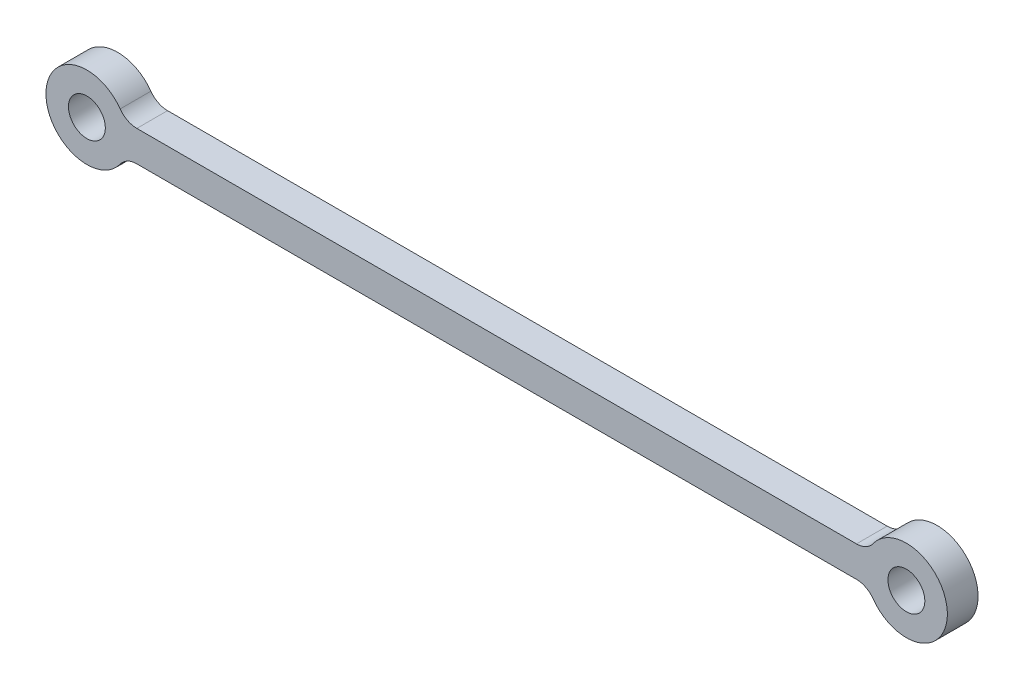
ISO-10303-21;
HEADER;
FILE_DESCRIPTION(('STEP AP214'),'2;1');
FILE_NAME('part.step','',(''),(''),'','','');
FILE_SCHEMA(('AUTOMOTIVE_DESIGN { 1 0 10303 214 1 1 1 1 }'));
ENDSEC;
DATA;
#1=APPLICATION_CONTEXT('core data for automotive mechanical design processes');
#2=APPLICATION_PROTOCOL_DEFINITION('international standard','automotive_design',2000,#1);
#3=PRODUCT_CONTEXT('',#1,'mechanical');
#4=PRODUCT('Part','Part','',(#3));
#5=PRODUCT_RELATED_PRODUCT_CATEGORY('part','',(#4));
#6=PRODUCT_DEFINITION_FORMATION('','',#4);
#7=PRODUCT_DEFINITION_CONTEXT('part definition',#1,'design');
#8=PRODUCT_DEFINITION('design','',#6,#7);
#9=PRODUCT_DEFINITION_SHAPE('','',#8);
#10=(LENGTH_UNIT() NAMED_UNIT(*) SI_UNIT(.MILLI.,.METRE.));
#11=(NAMED_UNIT(*) PLANE_ANGLE_UNIT() SI_UNIT($,.RADIAN.));
#12=(NAMED_UNIT(*) SI_UNIT($,.STERADIAN.) SOLID_ANGLE_UNIT());
#13=UNCERTAINTY_MEASURE_WITH_UNIT(LENGTH_MEASURE(1.E-05),#10,'distance_accuracy_value','');
#14=(GEOMETRIC_REPRESENTATION_CONTEXT(3) GLOBAL_UNCERTAINTY_ASSIGNED_CONTEXT((#13)) GLOBAL_UNIT_ASSIGNED_CONTEXT((#10,
#11,#12)) REPRESENTATION_CONTEXT('',''));
#15=CARTESIAN_POINT('',(0.,0.,0.));
#16=DIRECTION('',(0.,0.,1.));
#17=DIRECTION('',(1.,0.,0.));
#18=AXIS2_PLACEMENT_3D('',#15,#16,#17);
#19=CARTESIAN_POINT('',(-400.,0.,30.));
#20=DIRECTION('',(0.,0.,1.));
#21=DIRECTION('',(1.,0.,0.));
#22=AXIS2_PLACEMENT_3D('',#19,#20,#21);
#23=PLANE('',#22);
#24=CARTESIAN_POINT('',(-400.,0.,30.));
#25=DIRECTION('',(0.,0.,1.));
#26=DIRECTION('',(1.,0.,0.));
#27=AXIS2_PLACEMENT_3D('',#24,#25,#26);
#28=CIRCLE('',#27,18.);
#29=CARTESIAN_POINT('',(-382.,0.,30.));
#30=VERTEX_POINT('',#29);
#31=EDGE_CURVE('E175',#30,#30,#28,.T.);
#32=ORIENTED_EDGE('',*,*,#31,.F.);
#33=EDGE_LOOP('',(#32));
#34=FACE_BOUND('',#33,.T.);
#35=DIRECTION('',(1.,0.,0.));
#36=VECTOR('',#35,1.);
#37=CARTESIAN_POINT('',(-400.,-15.,30.));
#38=LINE('',#37,#36);
#39=CARTESIAN_POINT('',(-351.266028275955,-15.,30.));
#40=VERTEX_POINT('',#39);
#41=CARTESIAN_POINT('',(351.266028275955,-15.,30.));
#42=VERTEX_POINT('',#41);
#43=EDGE_CURVE('E100',#40,#42,#38,.T.);
#44=ORIENTED_EDGE('',*,*,#43,.T.);
#45=CARTESIAN_POINT('',(351.266028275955,-35.,30.));
#46=DIRECTION('',(0.,0.,1.));
#47=DIRECTION('',(1.,0.,0.));
#48=AXIS2_PLACEMENT_3D('',#45,#46,#47);
#49=CIRCLE('',#48,20.);
#50=CARTESIAN_POINT('',(367.510685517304,-23.3333333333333,30.));
#51=VERTEX_POINT('',#50);
#52=EDGE_CURVE('E147',#42,#51,#49,.F.);
#53=ORIENTED_EDGE('',*,*,#52,.T.);
#54=CARTESIAN_POINT('',(400.,0.,30.));
#55=DIRECTION('',(0.,0.,-1.));
#56=DIRECTION('',(-1.,0.,0.));
#57=AXIS2_PLACEMENT_3D('',#54,#55,#56);
#58=CIRCLE('',#57,40.);
#59=CARTESIAN_POINT('',(367.510685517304,23.3333333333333,30.));
#60=VERTEX_POINT('',#59);
#61=EDGE_CURVE('E149',#60,#51,#58,.T.);
#62=ORIENTED_EDGE('',*,*,#61,.F.);
#63=CARTESIAN_POINT('',(351.266028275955,35.,30.));
#64=DIRECTION('',(0.,0.,1.));
#65=DIRECTION('',(1.,0.,0.));
#66=AXIS2_PLACEMENT_3D('',#63,#64,#65);
#67=CIRCLE('',#66,20.);
#68=CARTESIAN_POINT('',(351.266028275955,15.,30.));
#69=VERTEX_POINT('',#68);
#70=EDGE_CURVE('E42',#60,#69,#67,.F.);
#71=ORIENTED_EDGE('',*,*,#70,.T.);
#72=DIRECTION('',(-1.,0.,0.));
#73=VECTOR('',#72,1.);
#74=CARTESIAN_POINT('',(-400.,15.,30.));
#75=LINE('',#74,#73);
#76=CARTESIAN_POINT('',(-351.266028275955,15.,30.));
#77=VERTEX_POINT('',#76);
#78=EDGE_CURVE('E118',#69,#77,#75,.T.);
#79=ORIENTED_EDGE('',*,*,#78,.T.);
#80=CARTESIAN_POINT('',(-351.266028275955,35.,30.));
#81=DIRECTION('',(0.,0.,1.));
#82=DIRECTION('',(1.,0.,0.));
#83=AXIS2_PLACEMENT_3D('',#80,#81,#82);
#84=CIRCLE('',#83,20.);
#85=CARTESIAN_POINT('',(-367.510685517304,23.3333333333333,30.));
#86=VERTEX_POINT('',#85);
#87=EDGE_CURVE('E107',#77,#86,#84,.F.);
#88=ORIENTED_EDGE('',*,*,#87,.T.);
#89=CARTESIAN_POINT('',(-400.,0.,30.));
#90=DIRECTION('',(0.,0.,1.));
#91=DIRECTION('',(1.,0.,0.));
#92=AXIS2_PLACEMENT_3D('',#89,#90,#91);
#93=CIRCLE('',#92,40.);
#94=CARTESIAN_POINT('',(-367.510685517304,-23.3333333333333,30.));
#95=VERTEX_POINT('',#94);
#96=EDGE_CURVE('E103',#86,#95,#93,.T.);
#97=ORIENTED_EDGE('',*,*,#96,.T.);
#98=CARTESIAN_POINT('',(-351.266028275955,-35.,30.));
#99=DIRECTION('',(0.,0.,1.));
#100=DIRECTION('',(1.,0.,0.));
#101=AXIS2_PLACEMENT_3D('',#98,#99,#100);
#102=CIRCLE('',#101,20.);
#103=EDGE_CURVE('E97',#95,#40,#102,.F.);
#104=ORIENTED_EDGE('',*,*,#103,.T.);
#105=EDGE_LOOP('',(#44,#53,#62,#71,#79,#88,#97,#104));
#106=FACE_BOUND('',#105,.T.);
#107=CARTESIAN_POINT('',(400.,0.,30.));
#108=DIRECTION('',(0.,0.,-1.));
#109=DIRECTION('',(-1.,0.,0.));
#110=AXIS2_PLACEMENT_3D('',#107,#108,#109);
#111=CIRCLE('',#110,18.);
#112=CARTESIAN_POINT('',(382.,0.,30.));
#113=VERTEX_POINT('',#112);
#114=EDGE_CURVE('E179',#113,#113,#111,.T.);
#115=ORIENTED_EDGE('',*,*,#114,.T.);
#116=EDGE_LOOP('',(#115));
#117=FACE_BOUND('',#116,.T.);
#118=ADVANCED_FACE('F34',(#34,#106,#117),#23,.T.);
#119=CARTESIAN_POINT('',(-400.,0.,0.));
#120=DIRECTION('',(0.,0.,1.));
#121=DIRECTION('',(1.,0.,0.));
#122=AXIS2_PLACEMENT_3D('',#119,#120,#121);
#123=PLANE('',#122);
#124=CARTESIAN_POINT('',(-400.,0.,0.));
#125=DIRECTION('',(0.,0.,1.));
#126=DIRECTION('',(1.,0.,0.));
#127=AXIS2_PLACEMENT_3D('',#124,#125,#126);
#128=CIRCLE('',#127,18.);
#129=CARTESIAN_POINT('',(-382.,0.,0.));
#130=VERTEX_POINT('',#129);
#131=EDGE_CURVE('E172',#130,#130,#128,.T.);
#132=ORIENTED_EDGE('',*,*,#131,.T.);
#133=EDGE_LOOP('',(#132));
#134=FACE_BOUND('',#133,.T.);
#135=CARTESIAN_POINT('',(400.,0.,0.));
#136=DIRECTION('',(0.,0.,1.));
#137=DIRECTION('',(1.,0.,0.));
#138=AXIS2_PLACEMENT_3D('',#135,#136,#137);
#139=CIRCLE('',#138,40.);
#140=CARTESIAN_POINT('',(367.510685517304,-23.3333333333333,0.));
#141=VERTEX_POINT('',#140);
#142=CARTESIAN_POINT('',(367.510685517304,23.3333333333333,0.));
#143=VERTEX_POINT('',#142);
#144=EDGE_CURVE('E157',#141,#143,#139,.T.);
#145=ORIENTED_EDGE('',*,*,#144,.F.);
#146=CARTESIAN_POINT('',(351.266028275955,-35.,0.));
#147=DIRECTION('',(0.,0.,1.));
#148=DIRECTION('',(1.,0.,0.));
#149=AXIS2_PLACEMENT_3D('',#146,#147,#148);
#150=CIRCLE('',#149,20.);
#151=CARTESIAN_POINT('',(351.266028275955,-15.,0.));
#152=VERTEX_POINT('',#151);
#153=EDGE_CURVE('E145',#141,#152,#150,.T.);
#154=ORIENTED_EDGE('',*,*,#153,.T.);
#155=DIRECTION('',(1.,0.,0.));
#156=VECTOR('',#155,1.);
#157=CARTESIAN_POINT('',(-400.,-15.,0.));
#158=LINE('',#157,#156);
#159=CARTESIAN_POINT('',(-351.266028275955,-15.,0.));
#160=VERTEX_POINT('',#159);
#161=EDGE_CURVE('E164',#160,#152,#158,.T.);
#162=ORIENTED_EDGE('',*,*,#161,.F.);
#163=CARTESIAN_POINT('',(-351.266028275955,-35.,0.));
#164=DIRECTION('',(0.,0.,1.));
#165=DIRECTION('',(1.,0.,0.));
#166=AXIS2_PLACEMENT_3D('',#163,#164,#165);
#167=CIRCLE('',#166,20.);
#168=CARTESIAN_POINT('',(-367.510685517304,-23.3333333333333,0.));
#169=VERTEX_POINT('',#168);
#170=EDGE_CURVE('E108',#160,#169,#167,.T.);
#171=ORIENTED_EDGE('',*,*,#170,.T.);
#172=CARTESIAN_POINT('',(-400.,0.,0.));
#173=DIRECTION('',(0.,0.,1.));
#174=DIRECTION('',(1.,0.,0.));
#175=AXIS2_PLACEMENT_3D('',#172,#173,#174);
#176=CIRCLE('',#175,40.);
#177=CARTESIAN_POINT('',(-367.510685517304,23.3333333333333,0.));
#178=VERTEX_POINT('',#177);
#179=EDGE_CURVE('E165',#169,#178,#176,.F.);
#180=ORIENTED_EDGE('',*,*,#179,.T.);
#181=CARTESIAN_POINT('',(-351.266028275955,35.,0.));
#182=DIRECTION('',(0.,0.,1.));
#183=DIRECTION('',(1.,0.,0.));
#184=AXIS2_PLACEMENT_3D('',#181,#182,#183);
#185=CIRCLE('',#184,20.);
#186=CARTESIAN_POINT('',(-351.266028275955,15.,0.));
#187=VERTEX_POINT('',#186);
#188=EDGE_CURVE('E134',#178,#187,#185,.T.);
#189=ORIENTED_EDGE('',*,*,#188,.T.);
#190=DIRECTION('',(-1.,0.,0.));
#191=VECTOR('',#190,1.);
#192=CARTESIAN_POINT('',(-400.,15.,0.));
#193=LINE('',#192,#191);
#194=CARTESIAN_POINT('',(351.266028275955,15.,0.));
#195=VERTEX_POINT('',#194);
#196=EDGE_CURVE('E119',#195,#187,#193,.T.);
#197=ORIENTED_EDGE('',*,*,#196,.F.);
#198=CARTESIAN_POINT('',(351.266028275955,35.,0.));
#199=DIRECTION('',(0.,0.,1.));
#200=DIRECTION('',(1.,0.,0.));
#201=AXIS2_PLACEMENT_3D('',#198,#199,#200);
#202=CIRCLE('',#201,20.);
#203=EDGE_CURVE('E11',#195,#143,#202,.T.);
#204=ORIENTED_EDGE('',*,*,#203,.T.);
#205=EDGE_LOOP('',(#145,#154,#162,#171,#180,#189,#197,#204));
#206=FACE_BOUND('',#205,.T.);
#207=CARTESIAN_POINT('',(400.,0.,0.));
#208=DIRECTION('',(0.,0.,-1.));
#209=DIRECTION('',(-1.,0.,0.));
#210=AXIS2_PLACEMENT_3D('',#207,#208,#209);
#211=CIRCLE('',#210,18.);
#212=CARTESIAN_POINT('',(382.,0.,0.));
#213=VERTEX_POINT('',#212);
#214=EDGE_CURVE('E158',#213,#213,#211,.T.);
#215=ORIENTED_EDGE('',*,*,#214,.F.);
#216=EDGE_LOOP('',(#215));
#217=FACE_BOUND('',#216,.T.);
#218=ADVANCED_FACE('F162',(#134,#206,#217),#123,.F.);
#219=CARTESIAN_POINT('',(-400.,-15.,30.));
#220=DIRECTION('',(0.,1.,0.));
#221=DIRECTION('',(0.,0.,1.));
#222=AXIS2_PLACEMENT_3D('',#219,#220,#221);
#223=PLANE('',#222);
#224=ORIENTED_EDGE('',*,*,#161,.T.);
#225=DIRECTION('',(0.,0.,-1.));
#226=VECTOR('',#225,1.);
#227=CARTESIAN_POINT('',(351.266028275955,-15.,30.));
#228=LINE('',#227,#226);
#229=EDGE_CURVE('E117',#152,#42,#228,.F.);
#230=ORIENTED_EDGE('',*,*,#229,.T.);
#231=ORIENTED_EDGE('',*,*,#43,.F.);
#232=DIRECTION('',(0.,0.,1.));
#233=VECTOR('',#232,1.);
#234=CARTESIAN_POINT('',(-351.266028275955,-15.,30.));
#235=LINE('',#234,#233);
#236=EDGE_CURVE('E114',#40,#160,#235,.F.);
#237=ORIENTED_EDGE('',*,*,#236,.T.);
#238=EDGE_LOOP('',(#224,#230,#231,#237));
#239=FACE_BOUND('',#238,.T.);
#240=ADVANCED_FACE('F113',(#239),#223,.F.);
#241=CARTESIAN_POINT('',(-400.,15.,30.));
#242=DIRECTION('',(0.,-1.,0.));
#243=DIRECTION('',(0.,0.,-1.));
#244=AXIS2_PLACEMENT_3D('',#241,#242,#243);
#245=PLANE('',#244);
#246=ORIENTED_EDGE('',*,*,#78,.F.);
#247=DIRECTION('',(0.,0.,-1.));
#248=VECTOR('',#247,1.);
#249=CARTESIAN_POINT('',(351.266028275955,15.,0.));
#250=LINE('',#249,#248);
#251=EDGE_CURVE('E55',#69,#195,#250,.T.);
#252=ORIENTED_EDGE('',*,*,#251,.T.);
#253=ORIENTED_EDGE('',*,*,#196,.T.);
#254=DIRECTION('',(0.,0.,1.));
#255=VECTOR('',#254,1.);
#256=CARTESIAN_POINT('',(-351.266028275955,15.,30.));
#257=LINE('',#256,#255);
#258=EDGE_CURVE('E129',#187,#77,#257,.T.);
#259=ORIENTED_EDGE('',*,*,#258,.T.);
#260=EDGE_LOOP('',(#246,#252,#253,#259));
#261=FACE_BOUND('',#260,.T.);
#262=ADVANCED_FACE('F194',(#261),#245,.F.);
#263=CARTESIAN_POINT('',(-400.,0.,-113.137084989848));
#264=DIRECTION('',(0.,0.,1.));
#265=DIRECTION('',(1.,0.,0.));
#266=AXIS2_PLACEMENT_3D('',#263,#264,#265);
#267=CYLINDRICAL_SURFACE('',#266,40.);
#268=ORIENTED_EDGE('',*,*,#179,.F.);
#269=DIRECTION('',(0.,0.,1.));
#270=VECTOR('',#269,1.);
#271=CARTESIAN_POINT('',(-367.510685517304,-23.3333333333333,-113.137084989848));
#272=LINE('',#271,#270);
#273=EDGE_CURVE('E124',#169,#95,#272,.T.);
#274=ORIENTED_EDGE('',*,*,#273,.T.);
#275=ORIENTED_EDGE('',*,*,#96,.F.);
#276=DIRECTION('',(0.,0.,1.));
#277=VECTOR('',#276,1.);
#278=CARTESIAN_POINT('',(-367.510685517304,23.3333333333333,-113.137084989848));
#279=LINE('',#278,#277);
#280=EDGE_CURVE('E122',#86,#178,#279,.F.);
#281=ORIENTED_EDGE('',*,*,#280,.T.);
#282=EDGE_LOOP('',(#268,#274,#275,#281));
#283=FACE_BOUND('',#282,.T.);
#284=ADVANCED_FACE('F199',(#283),#267,.T.);
#285=CARTESIAN_POINT('',(-400.,0.,0.));
#286=DIRECTION('',(0.,0.,1.));
#287=DIRECTION('',(1.,0.,0.));
#288=AXIS2_PLACEMENT_3D('',#285,#286,#287);
#289=CYLINDRICAL_SURFACE('',#288,18.);
#290=ORIENTED_EDGE('',*,*,#131,.F.);
#291=EDGE_LOOP('',(#290));
#292=FACE_BOUND('',#291,.T.);
#293=ORIENTED_EDGE('',*,*,#31,.T.);
#294=EDGE_LOOP('',(#293));
#295=FACE_BOUND('',#294,.T.);
#296=ADVANCED_FACE('F220',(#292,#295),#289,.F.);
#297=CARTESIAN_POINT('',(-351.266028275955,-35.,-113.137084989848));
#298=DIRECTION('',(0.,0.,1.));
#299=DIRECTION('',(1.,0.,0.));
#300=AXIS2_PLACEMENT_3D('',#297,#298,#299);
#301=CYLINDRICAL_SURFACE('',#300,20.);
#302=ORIENTED_EDGE('',*,*,#103,.F.);
#303=ORIENTED_EDGE('',*,*,#273,.F.);
#304=ORIENTED_EDGE('',*,*,#170,.F.);
#305=ORIENTED_EDGE('',*,*,#236,.F.);
#306=EDGE_LOOP('',(#302,#303,#304,#305));
#307=FACE_BOUND('',#306,.T.);
#308=ADVANCED_FACE('F121',(#307),#301,.F.);
#309=CARTESIAN_POINT('',(-351.266028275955,35.,-113.137084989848));
#310=DIRECTION('',(0.,0.,1.));
#311=DIRECTION('',(1.,0.,0.));
#312=AXIS2_PLACEMENT_3D('',#309,#310,#311);
#313=CYLINDRICAL_SURFACE('',#312,20.);
#314=ORIENTED_EDGE('',*,*,#188,.F.);
#315=ORIENTED_EDGE('',*,*,#280,.F.);
#316=ORIENTED_EDGE('',*,*,#87,.F.);
#317=ORIENTED_EDGE('',*,*,#258,.F.);
#318=EDGE_LOOP('',(#314,#315,#316,#317));
#319=FACE_BOUND('',#318,.T.);
#320=ADVANCED_FACE('F213',(#319),#313,.F.);
#321=CARTESIAN_POINT('',(400.,0.,-113.137084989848));
#322=DIRECTION('',(0.,0.,1.));
#323=DIRECTION('',(1.,0.,0.));
#324=AXIS2_PLACEMENT_3D('',#321,#322,#323);
#325=CYLINDRICAL_SURFACE('',#324,40.);
#326=ORIENTED_EDGE('',*,*,#61,.T.);
#327=DIRECTION('',(0.,0.,1.));
#328=VECTOR('',#327,1.);
#329=CARTESIAN_POINT('',(367.510685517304,-23.3333333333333,-113.137084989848));
#330=LINE('',#329,#328);
#331=EDGE_CURVE('E140',#51,#141,#330,.F.);
#332=ORIENTED_EDGE('',*,*,#331,.T.);
#333=ORIENTED_EDGE('',*,*,#144,.T.);
#334=DIRECTION('',(0.,0.,1.));
#335=VECTOR('',#334,1.);
#336=CARTESIAN_POINT('',(367.510685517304,23.3333333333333,-113.137084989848));
#337=LINE('',#336,#335);
#338=EDGE_CURVE('E137',#143,#60,#337,.T.);
#339=ORIENTED_EDGE('',*,*,#338,.T.);
#340=EDGE_LOOP('',(#326,#332,#333,#339));
#341=FACE_BOUND('',#340,.T.);
#342=ADVANCED_FACE('F153',(#341),#325,.T.);
#343=CARTESIAN_POINT('',(400.,0.,0.));
#344=DIRECTION('',(0.,0.,1.));
#345=DIRECTION('',(1.,0.,0.));
#346=AXIS2_PLACEMENT_3D('',#343,#344,#345);
#347=CYLINDRICAL_SURFACE('',#346,18.);
#348=ORIENTED_EDGE('',*,*,#214,.T.);
#349=EDGE_LOOP('',(#348));
#350=FACE_BOUND('',#349,.T.);
#351=ORIENTED_EDGE('',*,*,#114,.F.);
#352=EDGE_LOOP('',(#351));
#353=FACE_BOUND('',#352,.T.);
#354=ADVANCED_FACE('F185',(#350,#353),#347,.F.);
#355=CARTESIAN_POINT('',(351.266028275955,-35.,-113.137084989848));
#356=DIRECTION('',(0.,0.,1.));
#357=DIRECTION('',(1.,0.,0.));
#358=AXIS2_PLACEMENT_3D('',#355,#356,#357);
#359=CYLINDRICAL_SURFACE('',#358,20.);
#360=ORIENTED_EDGE('',*,*,#52,.F.);
#361=ORIENTED_EDGE('',*,*,#229,.F.);
#362=ORIENTED_EDGE('',*,*,#153,.F.);
#363=ORIENTED_EDGE('',*,*,#331,.F.);
#364=EDGE_LOOP('',(#360,#361,#362,#363));
#365=FACE_BOUND('',#364,.T.);
#366=ADVANCED_FACE('F160',(#365),#359,.F.);
#367=CARTESIAN_POINT('',(351.266028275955,35.,-113.137084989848));
#368=DIRECTION('',(0.,0.,1.));
#369=DIRECTION('',(1.,0.,0.));
#370=AXIS2_PLACEMENT_3D('',#367,#368,#369);
#371=CYLINDRICAL_SURFACE('',#370,20.);
#372=ORIENTED_EDGE('',*,*,#203,.F.);
#373=ORIENTED_EDGE('',*,*,#251,.F.);
#374=ORIENTED_EDGE('',*,*,#70,.F.);
#375=ORIENTED_EDGE('',*,*,#338,.F.);
#376=EDGE_LOOP('',(#372,#373,#374,#375));
#377=FACE_BOUND('',#376,.T.);
#378=ADVANCED_FACE('F36',(#377),#371,.F.);
#379=CLOSED_SHELL('',(#118,#218,#240,#262,#284,#296,#308,#320,#342,#354,#366,#378));
#380=MANIFOLD_SOLID_BREP('B2',#379);
#381=ADVANCED_BREP_SHAPE_REPRESENTATION('',(#18,#380),#14);
#382=SHAPE_DEFINITION_REPRESENTATION(#9,#381);
ENDSEC;
END-ISO-10303-21;
